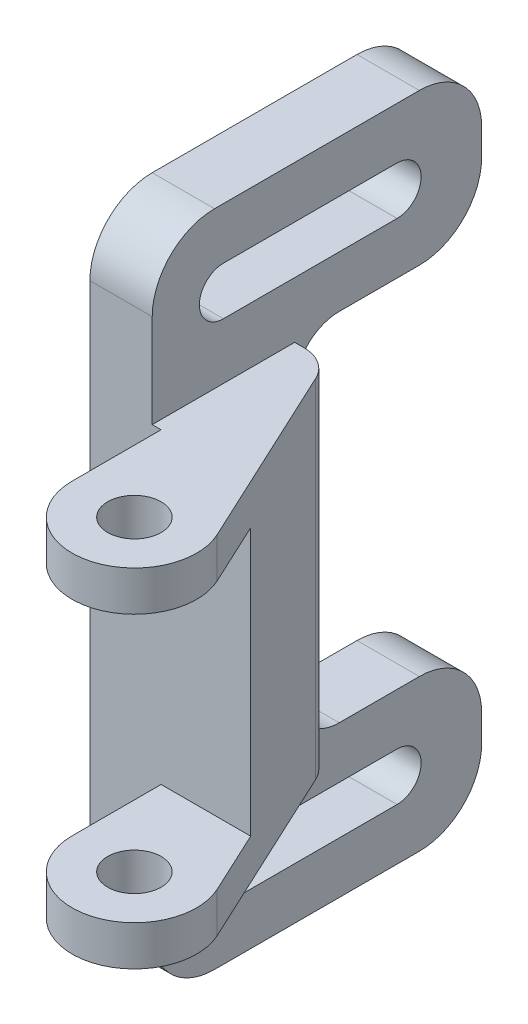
ISO-10303-21;
HEADER;
FILE_DESCRIPTION(('STEP AP214'),'2;1');
FILE_NAME('part.step','',(''),(''),'','','');
FILE_SCHEMA(('AUTOMOTIVE_DESIGN { 1 0 10303 214 1 1 1 1 }'));
ENDSEC;
DATA;
#1=APPLICATION_CONTEXT('core data for automotive mechanical design processes');
#2=APPLICATION_PROTOCOL_DEFINITION('international standard','automotive_design',2000,#1);
#3=PRODUCT_CONTEXT('',#1,'mechanical');
#4=PRODUCT('Part','Part','',(#3));
#5=PRODUCT_RELATED_PRODUCT_CATEGORY('part','',(#4));
#6=PRODUCT_DEFINITION_FORMATION('','',#4);
#7=PRODUCT_DEFINITION_CONTEXT('part definition',#1,'design');
#8=PRODUCT_DEFINITION('design','',#6,#7);
#9=PRODUCT_DEFINITION_SHAPE('','',#8);
#10=(LENGTH_UNIT() NAMED_UNIT(*) SI_UNIT(.MILLI.,.METRE.));
#11=(NAMED_UNIT(*) PLANE_ANGLE_UNIT() SI_UNIT($,.RADIAN.));
#12=(NAMED_UNIT(*) SI_UNIT($,.STERADIAN.) SOLID_ANGLE_UNIT());
#13=UNCERTAINTY_MEASURE_WITH_UNIT(LENGTH_MEASURE(1.E-05),#10,'distance_accuracy_value','');
#14=(GEOMETRIC_REPRESENTATION_CONTEXT(3) GLOBAL_UNCERTAINTY_ASSIGNED_CONTEXT((#13)) GLOBAL_UNIT_ASSIGNED_CONTEXT((#10,
#11,#12)) REPRESENTATION_CONTEXT('',''));
#15=CARTESIAN_POINT('',(0.,0.,0.));
#16=DIRECTION('',(0.,0.,1.));
#17=DIRECTION('',(1.,0.,0.));
#18=AXIS2_PLACEMENT_3D('',#15,#16,#17);
#19=CARTESIAN_POINT('',(15.,-19.5,0.));
#20=DIRECTION('',(0.,-1.,0.));
#21=DIRECTION('',(0.,0.,-1.));
#22=AXIS2_PLACEMENT_3D('',#19,#20,#21);
#23=CYLINDRICAL_SURFACE('',#22,3.);
#24=CARTESIAN_POINT('',(15.,-19.5,0.));
#25=DIRECTION('',(0.,-1.,0.));
#26=DIRECTION('',(0.,0.,-1.));
#27=AXIS2_PLACEMENT_3D('',#24,#25,#26);
#28=CIRCLE('',#27,3.);
#29=CARTESIAN_POINT('',(15.,-19.5,-3.));
#30=VERTEX_POINT('',#29);
#31=EDGE_CURVE('E474',#30,#30,#28,.F.);
#32=ORIENTED_EDGE('',*,*,#31,.F.);
#33=EDGE_LOOP('',(#32));
#34=FACE_BOUND('',#33,.T.);
#35=CARTESIAN_POINT('',(15.,-15.,0.));
#36=DIRECTION('',(0.,-1.,0.));
#37=DIRECTION('',(0.,0.,-1.));
#38=AXIS2_PLACEMENT_3D('',#35,#36,#37);
#39=CIRCLE('',#38,3.);
#40=CARTESIAN_POINT('',(15.,-15.,-3.));
#41=VERTEX_POINT('',#40);
#42=EDGE_CURVE('E305',#41,#41,#39,.F.);
#43=ORIENTED_EDGE('',*,*,#42,.T.);
#44=EDGE_LOOP('',(#43));
#45=FACE_BOUND('',#44,.T.);
#46=ADVANCED_FACE('F16',(#34,#45),#23,.F.);
#47=CARTESIAN_POINT('',(15.,-19.5,0.));
#48=DIRECTION('',(0.,-1.,0.));
#49=DIRECTION('',(0.,0.,-1.));
#50=AXIS2_PLACEMENT_3D('',#47,#48,#49);
#51=CYLINDRICAL_SURFACE('',#50,7.);
#52=CARTESIAN_POINT('',(15.,-19.5,0.));
#53=DIRECTION('',(0.,-1.,0.));
#54=DIRECTION('',(0.,0.,-1.));
#55=AXIS2_PLACEMENT_3D('',#52,#53,#54);
#56=CIRCLE('',#55,7.);
#57=CARTESIAN_POINT('',(21.3441545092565,-19.5,-2.9583278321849));
#58=VERTEX_POINT('',#57);
#59=CARTESIAN_POINT('',(8.,-19.5,0.));
#60=VERTEX_POINT('',#59);
#61=EDGE_CURVE('E479',#58,#60,#56,.T.);
#62=ORIENTED_EDGE('',*,*,#61,.F.);
#63=DIRECTION('',(0.,1.,0.));
#64=VECTOR('',#63,1.);
#65=CARTESIAN_POINT('',(21.3441545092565,-19.5,-2.95832783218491));
#66=LINE('',#65,#64);
#67=CARTESIAN_POINT('',(21.3441545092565,-15.,-2.9583278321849));
#68=VERTEX_POINT('',#67);
#69=EDGE_CURVE('E298',#68,#58,#66,.F.);
#70=ORIENTED_EDGE('',*,*,#69,.F.);
#71=CARTESIAN_POINT('',(15.,-15.,0.));
#72=DIRECTION('',(0.,-1.,0.));
#73=DIRECTION('',(0.,0.,-1.));
#74=AXIS2_PLACEMENT_3D('',#71,#72,#73);
#75=CIRCLE('',#74,7.);
#76=CARTESIAN_POINT('',(8.,-15.,0.));
#77=VERTEX_POINT('',#76);
#78=EDGE_CURVE('E317',#68,#77,#75,.T.);
#79=ORIENTED_EDGE('',*,*,#78,.T.);
#80=DIRECTION('',(0.,1.,0.));
#81=VECTOR('',#80,1.);
#82=CARTESIAN_POINT('',(8.,-19.5,0.));
#83=LINE('',#82,#81);
#84=EDGE_CURVE('E314',#60,#77,#83,.T.);
#85=ORIENTED_EDGE('',*,*,#84,.F.);
#86=EDGE_LOOP('',(#62,#70,#79,#85));
#87=FACE_BOUND('',#86,.T.);
#88=ADVANCED_FACE('F939',(#87),#51,.T.);
#89=CARTESIAN_POINT('',(15.,-19.5,0.));
#90=DIRECTION('',(0.,-1.,0.));
#91=DIRECTION('',(0.,0.,-1.));
#92=AXIS2_PLACEMENT_3D('',#89,#90,#91);
#93=CYLINDRICAL_SURFACE('',#92,7.);
#94=CARTESIAN_POINT('',(15.,15.,0.));
#95=DIRECTION('',(0.,-1.,0.));
#96=DIRECTION('',(0.,0.,-1.));
#97=AXIS2_PLACEMENT_3D('',#94,#95,#96);
#98=CIRCLE('',#97,7.);
#99=CARTESIAN_POINT('',(21.3441545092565,15.,-2.95832783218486));
#100=VERTEX_POINT('',#99);
#101=CARTESIAN_POINT('',(8.,15.,0.));
#102=VERTEX_POINT('',#101);
#103=EDGE_CURVE('E282',#100,#102,#98,.T.);
#104=ORIENTED_EDGE('',*,*,#103,.F.);
#105=DIRECTION('',(0.,1.,0.));
#106=VECTOR('',#105,1.);
#107=CARTESIAN_POINT('',(21.3441545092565,-19.5,-2.95832783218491));
#108=LINE('',#107,#106);
#109=CARTESIAN_POINT('',(21.3441545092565,19.5,-2.9583278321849));
#110=VERTEX_POINT('',#109);
#111=EDGE_CURVE('E273',#110,#100,#108,.F.);
#112=ORIENTED_EDGE('',*,*,#111,.F.);
#113=CARTESIAN_POINT('',(15.,19.5,0.));
#114=DIRECTION('',(0.,-1.,0.));
#115=DIRECTION('',(0.,0.,-1.));
#116=AXIS2_PLACEMENT_3D('',#113,#114,#115);
#117=CIRCLE('',#116,7.);
#118=CARTESIAN_POINT('',(8.,19.5,0.));
#119=VERTEX_POINT('',#118);
#120=EDGE_CURVE('E19',#110,#119,#117,.T.);
#121=ORIENTED_EDGE('',*,*,#120,.T.);
#122=DIRECTION('',(0.,1.,0.));
#123=VECTOR('',#122,1.);
#124=CARTESIAN_POINT('',(8.,-19.5,0.));
#125=LINE('',#124,#123);
#126=EDGE_CURVE('E332',#102,#119,#125,.T.);
#127=ORIENTED_EDGE('',*,*,#126,.F.);
#128=EDGE_LOOP('',(#104,#112,#121,#127));
#129=FACE_BOUND('',#128,.T.);
#130=ADVANCED_FACE('F281',(#129),#93,.T.);
#131=CARTESIAN_POINT('',(15.,-19.5,0.));
#132=DIRECTION('',(0.,-1.,0.));
#133=DIRECTION('',(0.,0.,-1.));
#134=AXIS2_PLACEMENT_3D('',#131,#132,#133);
#135=CYLINDRICAL_SURFACE('',#134,3.);
#136=CARTESIAN_POINT('',(15.,15.,0.));
#137=DIRECTION('',(0.,-1.,0.));
#138=DIRECTION('',(0.,0.,-1.));
#139=AXIS2_PLACEMENT_3D('',#136,#137,#138);
#140=CIRCLE('',#139,3.);
#141=CARTESIAN_POINT('',(15.,15.,-3.));
#142=VERTEX_POINT('',#141);
#143=EDGE_CURVE('E461',#142,#142,#140,.F.);
#144=ORIENTED_EDGE('',*,*,#143,.F.);
#145=EDGE_LOOP('',(#144));
#146=FACE_BOUND('',#145,.T.);
#147=CARTESIAN_POINT('',(15.,19.5,0.));
#148=DIRECTION('',(0.,-1.,0.));
#149=DIRECTION('',(0.,0.,-1.));
#150=AXIS2_PLACEMENT_3D('',#147,#148,#149);
#151=CIRCLE('',#150,3.);
#152=CARTESIAN_POINT('',(15.,19.5,-3.));
#153=VERTEX_POINT('',#152);
#154=EDGE_CURVE('E482',#153,#153,#151,.F.);
#155=ORIENTED_EDGE('',*,*,#154,.T.);
#156=EDGE_LOOP('',(#155));
#157=FACE_BOUND('',#156,.T.);
#158=ADVANCED_FACE('F933',(#146,#157),#135,.F.);
#159=CARTESIAN_POINT('',(0.,19.5,-18.));
#160=DIRECTION('',(0.,-1.,0.));
#161=DIRECTION('',(0.,0.,-1.));
#162=AXIS2_PLACEMENT_3D('',#159,#160,#161);
#163=PLANE('',#162);
#164=ORIENTED_EDGE('',*,*,#154,.F.);
#165=EDGE_LOOP('',(#164));
#166=FACE_BOUND('',#165,.T.);
#167=DIRECTION('',(0.,0.,-1.));
#168=VECTOR('',#167,1.);
#169=CARTESIAN_POINT('',(7.,19.5,-18.));
#170=LINE('',#169,#168);
#171=CARTESIAN_POINT('',(7.,19.5,-10.));
#172=VERTEX_POINT('',#171);
#173=CARTESIAN_POINT('',(7.,19.5,-26.));
#174=VERTEX_POINT('',#173);
#175=EDGE_CURVE('E457',#172,#174,#170,.T.);
#176=ORIENTED_EDGE('',*,*,#175,.F.);
#177=DIRECTION('',(1.,0.,0.));
#178=VECTOR('',#177,1.);
#179=CARTESIAN_POINT('',(0.,19.5,-10.));
#180=LINE('',#179,#178);
#181=CARTESIAN_POINT('',(8.,19.5,-10.));
#182=VERTEX_POINT('',#181);
#183=EDGE_CURVE('E269',#182,#172,#180,.F.);
#184=ORIENTED_EDGE('',*,*,#183,.F.);
#185=DIRECTION('',(0.,0.,1.));
#186=VECTOR('',#185,1.);
#187=CARTESIAN_POINT('',(8.,19.5,0.));
#188=LINE('',#187,#186);
#189=EDGE_CURVE('E264',#119,#182,#188,.F.);
#190=ORIENTED_EDGE('',*,*,#189,.F.);
#191=ORIENTED_EDGE('',*,*,#120,.F.);
#192=DIRECTION('',(-0.422618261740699,0.,-0.90630778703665));
#193=VECTOR('',#192,1.);
#194=CARTESIAN_POINT('',(11.6765964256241,19.5,-23.6904730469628));
#195=LINE('',#194,#193);
#196=CARTESIAN_POINT('',(11.6765964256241,19.5,-23.6904730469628));
#197=VERTEX_POINT('',#196);
#198=EDGE_CURVE('E260',#197,#110,#195,.F.);
#199=ORIENTED_EDGE('',*,*,#198,.F.);
#200=CARTESIAN_POINT('',(8.05136527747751,19.5,-22.));
#201=DIRECTION('',(0.,-1.,0.));
#202=DIRECTION('',(0.,0.,-1.));
#203=AXIS2_PLACEMENT_3D('',#200,#201,#202);
#204=CIRCLE('',#203,4.);
#205=CARTESIAN_POINT('',(8.0513652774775,19.5,-26.));
#206=VERTEX_POINT('',#205);
#207=EDGE_CURVE('E458',#206,#197,#204,.T.);
#208=ORIENTED_EDGE('',*,*,#207,.F.);
#209=DIRECTION('',(1.,0.,0.));
#210=VECTOR('',#209,1.);
#211=CARTESIAN_POINT('',(0.,19.5,-26.));
#212=LINE('',#211,#210);
#213=EDGE_CURVE('E485',#174,#206,#212,.T.);
#214=ORIENTED_EDGE('',*,*,#213,.F.);
#215=EDGE_LOOP('',(#176,#184,#190,#191,#199,#208,#214));
#216=FACE_BOUND('',#215,.T.);
#217=ADVANCED_FACE('F258',(#166,#216),#163,.F.);
#218=CARTESIAN_POINT('',(0.,-19.5,-18.));
#219=DIRECTION('',(0.,-1.,0.));
#220=DIRECTION('',(0.,0.,-1.));
#221=AXIS2_PLACEMENT_3D('',#218,#219,#220);
#222=PLANE('',#221);
#223=ORIENTED_EDGE('',*,*,#31,.T.);
#224=EDGE_LOOP('',(#223));
#225=FACE_BOUND('',#224,.T.);
#226=DIRECTION('',(0.,0.,1.));
#227=VECTOR('',#226,1.);
#228=CARTESIAN_POINT('',(8.,-19.5,0.));
#229=LINE('',#228,#227);
#230=CARTESIAN_POINT('',(8.,-19.5,-10.));
#231=VERTEX_POINT('',#230);
#232=EDGE_CURVE('E318',#231,#60,#229,.T.);
#233=ORIENTED_EDGE('',*,*,#232,.F.);
#234=DIRECTION('',(1.,0.,0.));
#235=VECTOR('',#234,1.);
#236=CARTESIAN_POINT('',(0.,-19.5,-10.));
#237=LINE('',#236,#235);
#238=CARTESIAN_POINT('',(7.,-19.5,-10.));
#239=VERTEX_POINT('',#238);
#240=EDGE_CURVE('E478',#231,#239,#237,.F.);
#241=ORIENTED_EDGE('',*,*,#240,.T.);
#242=DIRECTION('',(0.,0.,-1.));
#243=VECTOR('',#242,1.);
#244=CARTESIAN_POINT('',(7.,-19.5,-18.));
#245=LINE('',#244,#243);
#246=CARTESIAN_POINT('',(7.,-19.5,-26.));
#247=VERTEX_POINT('',#246);
#248=EDGE_CURVE('E558',#247,#239,#245,.F.);
#249=ORIENTED_EDGE('',*,*,#248,.F.);
#250=DIRECTION('',(1.,0.,0.));
#251=VECTOR('',#250,1.);
#252=CARTESIAN_POINT('',(0.,-19.5,-26.));
#253=LINE('',#252,#251);
#254=CARTESIAN_POINT('',(8.0513652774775,-19.5,-26.));
#255=VERTEX_POINT('',#254);
#256=EDGE_CURVE('E481',#247,#255,#253,.T.);
#257=ORIENTED_EDGE('',*,*,#256,.T.);
#258=CARTESIAN_POINT('',(8.05136527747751,-19.5,-22.));
#259=DIRECTION('',(0.,-1.,0.));
#260=DIRECTION('',(0.,0.,-1.));
#261=AXIS2_PLACEMENT_3D('',#258,#259,#260);
#262=CIRCLE('',#261,4.);
#263=CARTESIAN_POINT('',(11.6765964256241,-19.5,-23.6904730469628));
#264=VERTEX_POINT('',#263);
#265=EDGE_CURVE('E453',#264,#255,#262,.F.);
#266=ORIENTED_EDGE('',*,*,#265,.F.);
#267=DIRECTION('',(-0.422618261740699,0.,-0.90630778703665));
#268=VECTOR('',#267,1.);
#269=CARTESIAN_POINT('',(11.6765964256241,-19.5,-23.6904730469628));
#270=LINE('',#269,#268);
#271=EDGE_CURVE('E278',#58,#264,#270,.T.);
#272=ORIENTED_EDGE('',*,*,#271,.F.);
#273=ORIENTED_EDGE('',*,*,#61,.T.);
#274=EDGE_LOOP('',(#233,#241,#249,#257,#266,#272,#273));
#275=FACE_BOUND('',#274,.T.);
#276=ADVANCED_FACE('F619',(#225,#275),#222,.T.);
#277=CARTESIAN_POINT('',(8.,-19.5,0.));
#278=DIRECTION('',(-1.,0.,0.));
#279=DIRECTION('',(0.,0.,1.));
#280=AXIS2_PLACEMENT_3D('',#277,#278,#279);
#281=PLANE('',#280);
#282=ORIENTED_EDGE('',*,*,#189,.T.);
#283=DIRECTION('',(0.,1.,0.));
#284=VECTOR('',#283,1.);
#285=CARTESIAN_POINT('',(8.,-30.,-10.));
#286=LINE('',#285,#284);
#287=CARTESIAN_POINT('',(8.,15.,-10.));
#288=VERTEX_POINT('',#287);
#289=EDGE_CURVE('E525',#288,#182,#286,.T.);
#290=ORIENTED_EDGE('',*,*,#289,.F.);
#291=DIRECTION('',(0.,0.,-1.));
#292=VECTOR('',#291,1.);
#293=CARTESIAN_POINT('',(8.,15.,-18.));
#294=LINE('',#293,#292);
#295=EDGE_CURVE('E464',#102,#288,#294,.T.);
#296=ORIENTED_EDGE('',*,*,#295,.F.);
#297=ORIENTED_EDGE('',*,*,#126,.T.);
#298=EDGE_LOOP('',(#282,#290,#296,#297));
#299=FACE_BOUND('',#298,.T.);
#300=ADVANCED_FACE('F881',(#299),#281,.T.);
#301=CARTESIAN_POINT('',(8.,-19.5,0.));
#302=DIRECTION('',(-1.,0.,0.));
#303=DIRECTION('',(0.,0.,1.));
#304=AXIS2_PLACEMENT_3D('',#301,#302,#303);
#305=PLANE('',#304);
#306=ORIENTED_EDGE('',*,*,#232,.T.);
#307=ORIENTED_EDGE('',*,*,#84,.T.);
#308=DIRECTION('',(0.,0.,-1.));
#309=VECTOR('',#308,1.);
#310=CARTESIAN_POINT('',(8.,-15.,-18.));
#311=LINE('',#310,#309);
#312=CARTESIAN_POINT('',(8.,-15.,-10.));
#313=VERTEX_POINT('',#312);
#314=EDGE_CURVE('E470',#77,#313,#311,.T.);
#315=ORIENTED_EDGE('',*,*,#314,.T.);
#316=DIRECTION('',(0.,1.,0.));
#317=VECTOR('',#316,1.);
#318=CARTESIAN_POINT('',(8.,-30.,-10.));
#319=LINE('',#318,#317);
#320=EDGE_CURVE('E311',#231,#313,#319,.T.);
#321=ORIENTED_EDGE('',*,*,#320,.F.);
#322=EDGE_LOOP('',(#306,#307,#315,#321));
#323=FACE_BOUND('',#322,.T.);
#324=ADVANCED_FACE('F903',(#323),#305,.T.);
#325=CARTESIAN_POINT('',(0.,-15.,-18.));
#326=DIRECTION('',(0.,-1.,0.));
#327=DIRECTION('',(0.,0.,-1.));
#328=AXIS2_PLACEMENT_3D('',#325,#326,#327);
#329=PLANE('',#328);
#330=ORIENTED_EDGE('',*,*,#42,.F.);
#331=EDGE_LOOP('',(#330));
#332=FACE_BOUND('',#331,.T.);
#333=DIRECTION('',(1.,0.,0.));
#334=VECTOR('',#333,1.);
#335=CARTESIAN_POINT('',(0.,-15.,-10.));
#336=LINE('',#335,#334);
#337=CARTESIAN_POINT('',(18.0605688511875,-15.,-9.99999999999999));
#338=VERTEX_POINT('',#337);
#339=EDGE_CURVE('E295',#313,#338,#336,.T.);
#340=ORIENTED_EDGE('',*,*,#339,.F.);
#341=ORIENTED_EDGE('',*,*,#314,.F.);
#342=ORIENTED_EDGE('',*,*,#78,.F.);
#343=DIRECTION('',(-0.422618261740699,0.,-0.90630778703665));
#344=VECTOR('',#343,1.);
#345=CARTESIAN_POINT('',(11.6765964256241,-15.,-23.6904730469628));
#346=LINE('',#345,#344);
#347=EDGE_CURVE('E301',#338,#68,#346,.F.);
#348=ORIENTED_EDGE('',*,*,#347,.F.);
#349=EDGE_LOOP('',(#340,#341,#342,#348));
#350=FACE_BOUND('',#349,.T.);
#351=ADVANCED_FACE('F906',(#332,#350),#329,.F.);
#352=CARTESIAN_POINT('',(11.6765964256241,-19.5,-23.6904730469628));
#353=DIRECTION('',(0.90630778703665,0.,-0.422618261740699));
#354=DIRECTION('',(-0.422618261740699,0.,-0.90630778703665));
#355=AXIS2_PLACEMENT_3D('',#352,#353,#354);
#356=PLANE('',#355);
#357=ORIENTED_EDGE('',*,*,#198,.T.);
#358=ORIENTED_EDGE('',*,*,#111,.T.);
#359=DIRECTION('',(0.42261826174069,0.,0.906307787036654));
#360=VECTOR('',#359,1.);
#361=CARTESIAN_POINT('',(18.0605688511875,15.,-10.));
#362=LINE('',#361,#360);
#363=CARTESIAN_POINT('',(18.0605688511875,15.,-10.));
#364=VERTEX_POINT('',#363);
#365=EDGE_CURVE('E283',#364,#100,#362,.T.);
#366=ORIENTED_EDGE('',*,*,#365,.F.);
#367=DIRECTION('',(0.,1.,0.));
#368=VECTOR('',#367,1.);
#369=CARTESIAN_POINT('',(18.0605688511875,-30.,-10.));
#370=LINE('',#369,#368);
#371=EDGE_CURVE('E290',#338,#364,#370,.T.);
#372=ORIENTED_EDGE('',*,*,#371,.F.);
#373=ORIENTED_EDGE('',*,*,#347,.T.);
#374=ORIENTED_EDGE('',*,*,#69,.T.);
#375=ORIENTED_EDGE('',*,*,#271,.T.);
#376=DIRECTION('',(0.,-1.,0.));
#377=VECTOR('',#376,1.);
#378=CARTESIAN_POINT('',(11.6765964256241,-19.5,-23.6904730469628));
#379=LINE('',#378,#377);
#380=EDGE_CURVE('E276',#197,#264,#379,.T.);
#381=ORIENTED_EDGE('',*,*,#380,.F.);
#382=EDGE_LOOP('',(#357,#358,#366,#372,#373,#374,#375,#381));
#383=FACE_BOUND('',#382,.T.);
#384=ADVANCED_FACE('F271',(#383),#356,.T.);
#385=CARTESIAN_POINT('',(0.,15.,-18.));
#386=DIRECTION('',(0.,-1.,0.));
#387=DIRECTION('',(0.,0.,-1.));
#388=AXIS2_PLACEMENT_3D('',#385,#386,#387);
#389=PLANE('',#388);
#390=ORIENTED_EDGE('',*,*,#143,.T.);
#391=EDGE_LOOP('',(#390));
#392=FACE_BOUND('',#391,.T.);
#393=ORIENTED_EDGE('',*,*,#295,.T.);
#394=DIRECTION('',(1.,0.,0.));
#395=VECTOR('',#394,1.);
#396=CARTESIAN_POINT('',(0.,15.,-10.));
#397=LINE('',#396,#395);
#398=EDGE_CURVE('E294',#364,#288,#397,.F.);
#399=ORIENTED_EDGE('',*,*,#398,.F.);
#400=ORIENTED_EDGE('',*,*,#365,.T.);
#401=ORIENTED_EDGE('',*,*,#103,.T.);
#402=EDGE_LOOP('',(#393,#399,#400,#401));
#403=FACE_BOUND('',#402,.T.);
#404=ADVANCED_FACE('F909',(#392,#403),#389,.T.);
#405=CARTESIAN_POINT('',(8.05136527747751,-19.5,-22.));
#406=DIRECTION('',(0.,-1.,0.));
#407=DIRECTION('',(0.,0.,-1.));
#408=AXIS2_PLACEMENT_3D('',#405,#406,#407);
#409=CYLINDRICAL_SURFACE('',#408,4.);
#410=ORIENTED_EDGE('',*,*,#265,.T.);
#411=DIRECTION('',(0.,1.,0.));
#412=VECTOR('',#411,1.);
#413=CARTESIAN_POINT('',(8.0513652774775,15.,-26.));
#414=LINE('',#413,#412);
#415=EDGE_CURVE('E512',#206,#255,#414,.F.);
#416=ORIENTED_EDGE('',*,*,#415,.F.);
#417=ORIENTED_EDGE('',*,*,#207,.T.);
#418=ORIENTED_EDGE('',*,*,#380,.T.);
#419=EDGE_LOOP('',(#410,#416,#417,#418));
#420=FACE_BOUND('',#419,.T.);
#421=ADVANCED_FACE('F741',(#420),#409,.T.);
#422=CARTESIAN_POINT('',(7.,0.,-18.));
#423=DIRECTION('',(1.,0.,0.));
#424=DIRECTION('',(0.,0.,-1.));
#425=AXIS2_PLACEMENT_3D('',#422,#423,#424);
#426=PLANE('',#425);
#427=CARTESIAN_POINT('',(7.,28.5,-18.));
#428=DIRECTION('',(-1.,0.,0.));
#429=DIRECTION('',(0.,0.,1.));
#430=AXIS2_PLACEMENT_3D('',#427,#428,#429);
#431=CIRCLE('',#430,2.7);
#432=CARTESIAN_POINT('',(7.,25.8,-18.));
#433=VERTEX_POINT('',#432);
#434=CARTESIAN_POINT('',(7.,31.2,-18.));
#435=VERTEX_POINT('',#434);
#436=EDGE_CURVE('E407',#433,#435,#431,.T.);
#437=ORIENTED_EDGE('',*,*,#436,.T.);
#438=DIRECTION('',(0.,0.,-1.));
#439=VECTOR('',#438,1.);
#440=CARTESIAN_POINT('',(7.,31.2,-37.5));
#441=LINE('',#440,#439);
#442=CARTESIAN_POINT('',(7.,31.2,-37.5));
#443=VERTEX_POINT('',#442);
#444=EDGE_CURVE('E411',#443,#435,#441,.F.);
#445=ORIENTED_EDGE('',*,*,#444,.F.);
#446=CARTESIAN_POINT('',(7.,28.5,-37.5));
#447=DIRECTION('',(-1.,0.,0.));
#448=DIRECTION('',(0.,0.,1.));
#449=AXIS2_PLACEMENT_3D('',#446,#447,#448);
#450=CIRCLE('',#449,2.7);
#451=CARTESIAN_POINT('',(7.,25.8,-37.5));
#452=VERTEX_POINT('',#451);
#453=EDGE_CURVE('E401',#443,#452,#450,.T.);
#454=ORIENTED_EDGE('',*,*,#453,.T.);
#455=DIRECTION('',(0.,0.,1.));
#456=VECTOR('',#455,1.);
#457=CARTESIAN_POINT('',(7.,25.8,-18.));
#458=LINE('',#457,#456);
#459=EDGE_CURVE('E405',#433,#452,#458,.F.);
#460=ORIENTED_EDGE('',*,*,#459,.F.);
#461=EDGE_LOOP('',(#437,#445,#454,#460));
#462=FACE_BOUND('',#461,.T.);
#463=DIRECTION('',(0.,1.,0.));
#464=VECTOR('',#463,1.);
#465=CARTESIAN_POINT('',(6.99999999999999,-30.,-10.));
#466=LINE('',#465,#464);
#467=CARTESIAN_POINT('',(7.,30.,-10.));
#468=VERTEX_POINT('',#467);
#469=EDGE_CURVE('E528',#172,#468,#466,.T.);
#470=ORIENTED_EDGE('',*,*,#469,.F.);
#471=ORIENTED_EDGE('',*,*,#175,.T.);
#472=DIRECTION('',(0.,1.,0.));
#473=VECTOR('',#472,1.);
#474=CARTESIAN_POINT('',(7.,15.,-26.));
#475=LINE('',#474,#473);
#476=CARTESIAN_POINT('',(7.,15.,-26.));
#477=VERTEX_POINT('',#476);
#478=EDGE_CURVE('E516',#477,#174,#475,.T.);
#479=ORIENTED_EDGE('',*,*,#478,.F.);
#480=CARTESIAN_POINT('',(7.,15.,-31.));
#481=DIRECTION('',(-1.,0.,0.));
#482=DIRECTION('',(0.,0.,1.));
#483=AXIS2_PLACEMENT_3D('',#480,#481,#482);
#484=CIRCLE('',#483,5.);
#485=CARTESIAN_POINT('',(7.,20.,-31.));
#486=VERTEX_POINT('',#485);
#487=EDGE_CURVE('E423',#477,#486,#484,.T.);
#488=ORIENTED_EDGE('',*,*,#487,.T.);
#489=DIRECTION('',(0.,0.,-1.));
#490=VECTOR('',#489,1.);
#491=CARTESIAN_POINT('',(7.,20.,-40.));
#492=LINE('',#491,#490);
#493=CARTESIAN_POINT('',(7.,20.,-40.));
#494=VERTEX_POINT('',#493);
#495=EDGE_CURVE('E427',#494,#486,#492,.F.);
#496=ORIENTED_EDGE('',*,*,#495,.F.);
#497=CARTESIAN_POINT('',(7.,27.,-40.));
#498=DIRECTION('',(-1.,0.,0.));
#499=DIRECTION('',(0.,0.,1.));
#500=AXIS2_PLACEMENT_3D('',#497,#498,#499);
#501=CIRCLE('',#500,7.00000000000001);
#502=CARTESIAN_POINT('',(7.,27.,-47.));
#503=VERTEX_POINT('',#502);
#504=EDGE_CURVE('E418',#503,#494,#501,.T.);
#505=ORIENTED_EDGE('',*,*,#504,.F.);
#506=DIRECTION('',(0.,1.,0.));
#507=VECTOR('',#506,1.);
#508=CARTESIAN_POINT('',(7.,30.,-47.));
#509=LINE('',#508,#507);
#510=CARTESIAN_POINT('',(7.,30.,-47.));
#511=VERTEX_POINT('',#510);
#512=EDGE_CURVE('E559',#511,#503,#509,.F.);
#513=ORIENTED_EDGE('',*,*,#512,.F.);
#514=CARTESIAN_POINT('',(7.,30.,-40.));
#515=DIRECTION('',(-1.,0.,0.));
#516=DIRECTION('',(0.,0.,1.));
#517=AXIS2_PLACEMENT_3D('',#514,#515,#516);
#518=CIRCLE('',#517,7.00000000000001);
#519=CARTESIAN_POINT('',(7.,37.,-40.));
#520=VERTEX_POINT('',#519);
#521=EDGE_CURVE('E413',#520,#511,#518,.T.);
#522=ORIENTED_EDGE('',*,*,#521,.F.);
#523=DIRECTION('',(0.,0.,1.));
#524=VECTOR('',#523,1.);
#525=CARTESIAN_POINT('',(7.,37.,-17.));
#526=LINE('',#525,#524);
#527=CARTESIAN_POINT('',(7.,37.,-17.));
#528=VERTEX_POINT('',#527);
#529=EDGE_CURVE('E452',#528,#520,#526,.F.);
#530=ORIENTED_EDGE('',*,*,#529,.F.);
#531=CARTESIAN_POINT('',(7.,30.,-17.));
#532=DIRECTION('',(-1.,0.,0.));
#533=DIRECTION('',(0.,0.,1.));
#534=AXIS2_PLACEMENT_3D('',#531,#532,#533);
#535=CIRCLE('',#534,7.);
#536=EDGE_CURVE('E448',#468,#528,#535,.T.);
#537=ORIENTED_EDGE('',*,*,#536,.F.);
#538=EDGE_LOOP('',(#470,#471,#479,#488,#496,#505,#513,#522,#530,#537));
#539=FACE_BOUND('',#538,.T.);
#540=ADVANCED_FACE('F730',(#462,#539),#426,.T.);
#541=CARTESIAN_POINT('',(7.,0.,-18.));
#542=DIRECTION('',(1.,0.,0.));
#543=DIRECTION('',(0.,0.,-1.));
#544=AXIS2_PLACEMENT_3D('',#541,#542,#543);
#545=PLANE('',#544);
#546=CARTESIAN_POINT('',(7.,-28.5,-18.));
#547=DIRECTION('',(-1.,0.,0.));
#548=DIRECTION('',(0.,0.,1.));
#549=AXIS2_PLACEMENT_3D('',#546,#547,#548);
#550=CIRCLE('',#549,2.7);
#551=CARTESIAN_POINT('',(7.,-31.2,-18.));
#552=VERTEX_POINT('',#551);
#553=CARTESIAN_POINT('',(7.,-25.8,-18.));
#554=VERTEX_POINT('',#553);
#555=EDGE_CURVE('E396',#552,#554,#550,.T.);
#556=ORIENTED_EDGE('',*,*,#555,.T.);
#557=DIRECTION('',(0.,0.,-1.));
#558=VECTOR('',#557,1.);
#559=CARTESIAN_POINT('',(7.,-25.8,-37.5));
#560=LINE('',#559,#558);
#561=CARTESIAN_POINT('',(7.,-25.8,-37.5));
#562=VERTEX_POINT('',#561);
#563=EDGE_CURVE('E399',#562,#554,#560,.F.);
#564=ORIENTED_EDGE('',*,*,#563,.F.);
#565=CARTESIAN_POINT('',(7.,-28.5,-37.5));
#566=DIRECTION('',(-1.,0.,0.));
#567=DIRECTION('',(0.,0.,1.));
#568=AXIS2_PLACEMENT_3D('',#565,#566,#567);
#569=CIRCLE('',#568,2.7);
#570=CARTESIAN_POINT('',(7.,-31.2,-37.5));
#571=VERTEX_POINT('',#570);
#572=EDGE_CURVE('E390',#562,#571,#569,.T.);
#573=ORIENTED_EDGE('',*,*,#572,.T.);
#574=DIRECTION('',(0.,0.,1.));
#575=VECTOR('',#574,1.);
#576=CARTESIAN_POINT('',(7.,-31.2,-18.));
#577=LINE('',#576,#575);
#578=EDGE_CURVE('E394',#552,#571,#577,.F.);
#579=ORIENTED_EDGE('',*,*,#578,.F.);
#580=EDGE_LOOP('',(#556,#564,#573,#579));
#581=FACE_BOUND('',#580,.T.);
#582=DIRECTION('',(0.,0.,1.));
#583=VECTOR('',#582,1.);
#584=CARTESIAN_POINT('',(7.,-20.,-31.));
#585=LINE('',#584,#583);
#586=CARTESIAN_POINT('',(7.,-20.,-31.));
#587=VERTEX_POINT('',#586);
#588=CARTESIAN_POINT('',(7.,-20.,-40.));
#589=VERTEX_POINT('',#588);
#590=EDGE_CURVE('E582',#587,#589,#585,.F.);
#591=ORIENTED_EDGE('',*,*,#590,.F.);
#592=CARTESIAN_POINT('',(7.,-15.,-31.));
#593=DIRECTION('',(-1.,0.,0.));
#594=DIRECTION('',(0.,0.,1.));
#595=AXIS2_PLACEMENT_3D('',#592,#593,#594);
#596=CIRCLE('',#595,5.);
#597=CARTESIAN_POINT('',(7.,-15.,-26.));
#598=VERTEX_POINT('',#597);
#599=EDGE_CURVE('E429',#587,#598,#596,.T.);
#600=ORIENTED_EDGE('',*,*,#599,.T.);
#601=DIRECTION('',(0.,1.,0.));
#602=VECTOR('',#601,1.);
#603=CARTESIAN_POINT('',(7.,15.,-26.));
#604=LINE('',#603,#602);
#605=EDGE_CURVE('E515',#247,#598,#604,.T.);
#606=ORIENTED_EDGE('',*,*,#605,.F.);
#607=ORIENTED_EDGE('',*,*,#248,.T.);
#608=DIRECTION('',(0.,1.,0.));
#609=VECTOR('',#608,1.);
#610=CARTESIAN_POINT('',(7.,-30.,-10.));
#611=LINE('',#610,#609);
#612=CARTESIAN_POINT('',(7.,-30.,-9.99999999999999));
#613=VERTEX_POINT('',#612);
#614=EDGE_CURVE('E322',#613,#239,#611,.T.);
#615=ORIENTED_EDGE('',*,*,#614,.F.);
#616=CARTESIAN_POINT('',(7.,-30.,-17.));
#617=DIRECTION('',(-1.,0.,0.));
#618=DIRECTION('',(0.,0.,1.));
#619=AXIS2_PLACEMENT_3D('',#616,#617,#618);
#620=CIRCLE('',#619,7.00000000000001);
#621=CARTESIAN_POINT('',(7.,-37.,-17.));
#622=VERTEX_POINT('',#621);
#623=EDGE_CURVE('E444',#622,#613,#620,.T.);
#624=ORIENTED_EDGE('',*,*,#623,.F.);
#625=DIRECTION('',(0.,0.,-1.));
#626=VECTOR('',#625,1.);
#627=CARTESIAN_POINT('',(7.,-37.,-40.));
#628=LINE('',#627,#626);
#629=CARTESIAN_POINT('',(7.,-37.,-40.));
#630=VERTEX_POINT('',#629);
#631=EDGE_CURVE('E589',#630,#622,#628,.F.);
#632=ORIENTED_EDGE('',*,*,#631,.F.);
#633=CARTESIAN_POINT('',(7.,-30.,-40.));
#634=DIRECTION('',(-1.,0.,0.));
#635=DIRECTION('',(0.,0.,1.));
#636=AXIS2_PLACEMENT_3D('',#633,#634,#635);
#637=CIRCLE('',#636,7.00000000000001);
#638=CARTESIAN_POINT('',(7.,-30.,-47.));
#639=VERTEX_POINT('',#638);
#640=EDGE_CURVE('E439',#639,#630,#637,.T.);
#641=ORIENTED_EDGE('',*,*,#640,.F.);
#642=DIRECTION('',(0.,1.,0.));
#643=VECTOR('',#642,1.);
#644=CARTESIAN_POINT('',(7.,-27.,-47.));
#645=LINE('',#644,#643);
#646=CARTESIAN_POINT('',(7.,-27.,-47.));
#647=VERTEX_POINT('',#646);
#648=EDGE_CURVE('E586',#647,#639,#645,.F.);
#649=ORIENTED_EDGE('',*,*,#648,.F.);
#650=CARTESIAN_POINT('',(7.,-27.,-40.));
#651=DIRECTION('',(-1.,0.,0.));
#652=DIRECTION('',(0.,0.,1.));
#653=AXIS2_PLACEMENT_3D('',#650,#651,#652);
#654=CIRCLE('',#653,7.00000000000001);
#655=EDGE_CURVE('E434',#589,#647,#654,.T.);
#656=ORIENTED_EDGE('',*,*,#655,.F.);
#657=EDGE_LOOP('',(#591,#600,#606,#607,#615,#624,#632,#641,#649,#656));
#658=FACE_BOUND('',#657,.T.);
#659=ADVANCED_FACE('F627',(#581,#658),#545,.T.);
#660=CARTESIAN_POINT('',(0.,37.,-17.));
#661=DIRECTION('',(0.,1.,0.));
#662=DIRECTION('',(0.,0.,1.));
#663=AXIS2_PLACEMENT_3D('',#660,#661,#662);
#664=PLANE('',#663);
#665=DIRECTION('',(0.,0.,-1.));
#666=VECTOR('',#665,1.);
#667=CARTESIAN_POINT('',(0.,37.,-18.));
#668=LINE('',#667,#666);
#669=CARTESIAN_POINT('',(0.,37.,-40.));
#670=VERTEX_POINT('',#669);
#671=CARTESIAN_POINT('',(0.,37.,-17.));
#672=VERTEX_POINT('',#671);
#673=EDGE_CURVE('E389',#670,#672,#668,.F.);
#674=ORIENTED_EDGE('',*,*,#673,.T.);
#675=DIRECTION('',(-1.,0.,0.));
#676=VECTOR('',#675,1.);
#677=CARTESIAN_POINT('',(0.,37.,-17.));
#678=LINE('',#677,#676);
#679=EDGE_CURVE('E451',#528,#672,#678,.T.);
#680=ORIENTED_EDGE('',*,*,#679,.F.);
#681=ORIENTED_EDGE('',*,*,#529,.T.);
#682=DIRECTION('',(-1.,0.,0.));
#683=VECTOR('',#682,1.);
#684=CARTESIAN_POINT('',(0.,37.,-40.));
#685=LINE('',#684,#683);
#686=EDGE_CURVE('E412',#670,#520,#685,.F.);
#687=ORIENTED_EDGE('',*,*,#686,.F.);
#688=EDGE_LOOP('',(#674,#680,#681,#687));
#689=FACE_BOUND('',#688,.T.);
#690=ADVANCED_FACE('F729',(#689),#664,.T.);
#691=CARTESIAN_POINT('',(0.,30.,-17.));
#692=DIRECTION('',(-1.,0.,0.));
#693=DIRECTION('',(0.,0.,1.));
#694=AXIS2_PLACEMENT_3D('',#691,#692,#693);
#695=CYLINDRICAL_SURFACE('',#694,7.);
#696=CARTESIAN_POINT('',(0.,30.,-17.));
#697=DIRECTION('',(-1.,0.,0.));
#698=DIRECTION('',(0.,0.,1.));
#699=AXIS2_PLACEMENT_3D('',#696,#697,#698);
#700=CIRCLE('',#699,7.);
#701=CARTESIAN_POINT('',(0.,30.,-10.));
#702=VERTEX_POINT('',#701);
#703=EDGE_CURVE('E385',#672,#702,#700,.F.);
#704=ORIENTED_EDGE('',*,*,#703,.T.);
#705=DIRECTION('',(1.,0.,0.));
#706=VECTOR('',#705,1.);
#707=CARTESIAN_POINT('',(0.,30.,-10.));
#708=LINE('',#707,#706);
#709=EDGE_CURVE('E533',#468,#702,#708,.F.);
#710=ORIENTED_EDGE('',*,*,#709,.F.);
#711=ORIENTED_EDGE('',*,*,#536,.T.);
#712=ORIENTED_EDGE('',*,*,#679,.T.);
#713=EDGE_LOOP('',(#704,#710,#711,#712));
#714=FACE_BOUND('',#713,.T.);
#715=ADVANCED_FACE('F737',(#714),#695,.T.);
#716=CARTESIAN_POINT('',(0.,-30.,-10.));
#717=DIRECTION('',(0.,0.,1.));
#718=DIRECTION('',(1.,0.,0.));
#719=AXIS2_PLACEMENT_3D('',#716,#717,#718);
#720=PLANE('',#719);
#721=ORIENTED_EDGE('',*,*,#371,.T.);
#722=ORIENTED_EDGE('',*,*,#398,.T.);
#723=ORIENTED_EDGE('',*,*,#289,.T.);
#724=ORIENTED_EDGE('',*,*,#183,.T.);
#725=ORIENTED_EDGE('',*,*,#469,.T.);
#726=ORIENTED_EDGE('',*,*,#709,.T.);
#727=DIRECTION('',(0.,1.,0.));
#728=VECTOR('',#727,1.);
#729=CARTESIAN_POINT('',(0.,0.,-10.));
#730=LINE('',#729,#728);
#731=CARTESIAN_POINT('',(0.,-30.,-9.99999999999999));
#732=VERTEX_POINT('',#731);
#733=EDGE_CURVE('E384',#702,#732,#730,.F.);
#734=ORIENTED_EDGE('',*,*,#733,.T.);
#735=DIRECTION('',(-1.,0.,0.));
#736=VECTOR('',#735,1.);
#737=CARTESIAN_POINT('',(0.,-30.,-9.99999999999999));
#738=LINE('',#737,#736);
#739=EDGE_CURVE('E447',#613,#732,#738,.T.);
#740=ORIENTED_EDGE('',*,*,#739,.F.);
#741=ORIENTED_EDGE('',*,*,#614,.T.);
#742=ORIENTED_EDGE('',*,*,#240,.F.);
#743=ORIENTED_EDGE('',*,*,#320,.T.);
#744=ORIENTED_EDGE('',*,*,#339,.T.);
#745=EDGE_LOOP('',(#721,#722,#723,#724,#725,#726,#734,#740,#741,#742,#743,#744));
#746=FACE_BOUND('',#745,.T.);
#747=ADVANCED_FACE('F630',(#746),#720,.T.);
#748=CARTESIAN_POINT('',(0.,-30.,-17.));
#749=DIRECTION('',(-1.,0.,0.));
#750=DIRECTION('',(0.,0.,1.));
#751=AXIS2_PLACEMENT_3D('',#748,#749,#750);
#752=CYLINDRICAL_SURFACE('',#751,7.00000000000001);
#753=CARTESIAN_POINT('',(0.,-30.,-17.));
#754=DIRECTION('',(-1.,0.,0.));
#755=DIRECTION('',(0.,0.,1.));
#756=AXIS2_PLACEMENT_3D('',#753,#754,#755);
#757=CIRCLE('',#756,7.00000000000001);
#758=CARTESIAN_POINT('',(0.,-37.,-17.));
#759=VERTEX_POINT('',#758);
#760=EDGE_CURVE('E380',#732,#759,#757,.F.);
#761=ORIENTED_EDGE('',*,*,#760,.T.);
#762=DIRECTION('',(1.,0.,0.));
#763=VECTOR('',#762,1.);
#764=CARTESIAN_POINT('',(0.,-37.,-17.));
#765=LINE('',#764,#763);
#766=EDGE_CURVE('E443',#622,#759,#765,.F.);
#767=ORIENTED_EDGE('',*,*,#766,.F.);
#768=ORIENTED_EDGE('',*,*,#623,.T.);
#769=ORIENTED_EDGE('',*,*,#739,.T.);
#770=EDGE_LOOP('',(#761,#767,#768,#769));
#771=FACE_BOUND('',#770,.T.);
#772=ADVANCED_FACE('F817',(#771),#752,.T.);
#773=CARTESIAN_POINT('',(0.,-37.,-40.));
#774=DIRECTION('',(0.,-1.,0.));
#775=DIRECTION('',(0.,0.,-1.));
#776=AXIS2_PLACEMENT_3D('',#773,#774,#775);
#777=PLANE('',#776);
#778=DIRECTION('',(0.,0.,-1.));
#779=VECTOR('',#778,1.);
#780=CARTESIAN_POINT('',(0.,-37.,-18.));
#781=LINE('',#780,#779);
#782=CARTESIAN_POINT('',(0.,-37.,-40.));
#783=VERTEX_POINT('',#782);
#784=EDGE_CURVE('E379',#759,#783,#781,.T.);
#785=ORIENTED_EDGE('',*,*,#784,.T.);
#786=DIRECTION('',(-1.,0.,0.));
#787=VECTOR('',#786,1.);
#788=CARTESIAN_POINT('',(0.,-37.,-40.));
#789=LINE('',#788,#787);
#790=EDGE_CURVE('E442',#630,#783,#789,.T.);
#791=ORIENTED_EDGE('',*,*,#790,.F.);
#792=ORIENTED_EDGE('',*,*,#631,.T.);
#793=ORIENTED_EDGE('',*,*,#766,.T.);
#794=EDGE_LOOP('',(#785,#791,#792,#793));
#795=FACE_BOUND('',#794,.T.);
#796=ADVANCED_FACE('F813',(#795),#777,.T.);
#797=CARTESIAN_POINT('',(0.,-30.,-40.));
#798=DIRECTION('',(-1.,0.,0.));
#799=DIRECTION('',(0.,0.,1.));
#800=AXIS2_PLACEMENT_3D('',#797,#798,#799);
#801=CYLINDRICAL_SURFACE('',#800,7.00000000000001);
#802=CARTESIAN_POINT('',(0.,-30.,-40.));
#803=DIRECTION('',(-1.,0.,0.));
#804=DIRECTION('',(0.,0.,1.));
#805=AXIS2_PLACEMENT_3D('',#802,#803,#804);
#806=CIRCLE('',#805,7.00000000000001);
#807=CARTESIAN_POINT('',(0.,-30.,-47.));
#808=VERTEX_POINT('',#807);
#809=EDGE_CURVE('E375',#783,#808,#806,.F.);
#810=ORIENTED_EDGE('',*,*,#809,.T.);
#811=DIRECTION('',(-1.,0.,0.));
#812=VECTOR('',#811,1.);
#813=CARTESIAN_POINT('',(0.,-30.,-47.));
#814=LINE('',#813,#812);
#815=EDGE_CURVE('E438',#639,#808,#814,.T.);
#816=ORIENTED_EDGE('',*,*,#815,.F.);
#817=ORIENTED_EDGE('',*,*,#640,.T.);
#818=ORIENTED_EDGE('',*,*,#790,.T.);
#819=EDGE_LOOP('',(#810,#816,#817,#818));
#820=FACE_BOUND('',#819,.T.);
#821=ADVANCED_FACE('F809',(#820),#801,.T.);
#822=CARTESIAN_POINT('',(0.,-27.,-47.));
#823=DIRECTION('',(0.,0.,-1.));
#824=DIRECTION('',(-1.,0.,0.));
#825=AXIS2_PLACEMENT_3D('',#822,#823,#824);
#826=PLANE('',#825);
#827=DIRECTION('',(0.,1.,0.));
#828=VECTOR('',#827,1.);
#829=CARTESIAN_POINT('',(0.,0.,-47.));
#830=LINE('',#829,#828);
#831=CARTESIAN_POINT('',(0.,-27.,-47.));
#832=VERTEX_POINT('',#831);
#833=EDGE_CURVE('E374',#808,#832,#830,.T.);
#834=ORIENTED_EDGE('',*,*,#833,.T.);
#835=DIRECTION('',(-1.,0.,0.));
#836=VECTOR('',#835,1.);
#837=CARTESIAN_POINT('',(0.,-27.,-47.));
#838=LINE('',#837,#836);
#839=EDGE_CURVE('E437',#647,#832,#838,.T.);
#840=ORIENTED_EDGE('',*,*,#839,.F.);
#841=ORIENTED_EDGE('',*,*,#648,.T.);
#842=ORIENTED_EDGE('',*,*,#815,.T.);
#843=EDGE_LOOP('',(#834,#840,#841,#842));
#844=FACE_BOUND('',#843,.T.);
#845=ADVANCED_FACE('F805',(#844),#826,.T.);
#846=CARTESIAN_POINT('',(0.,-27.,-40.));
#847=DIRECTION('',(-1.,0.,0.));
#848=DIRECTION('',(0.,0.,1.));
#849=AXIS2_PLACEMENT_3D('',#846,#847,#848);
#850=CYLINDRICAL_SURFACE('',#849,7.00000000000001);
#851=CARTESIAN_POINT('',(0.,-27.,-40.));
#852=DIRECTION('',(-1.,0.,0.));
#853=DIRECTION('',(0.,0.,1.));
#854=AXIS2_PLACEMENT_3D('',#851,#852,#853);
#855=CIRCLE('',#854,7.00000000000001);
#856=CARTESIAN_POINT('',(0.,-20.,-40.));
#857=VERTEX_POINT('',#856);
#858=EDGE_CURVE('E370',#832,#857,#855,.F.);
#859=ORIENTED_EDGE('',*,*,#858,.T.);
#860=DIRECTION('',(1.,0.,0.));
#861=VECTOR('',#860,1.);
#862=CARTESIAN_POINT('',(0.,-20.,-40.));
#863=LINE('',#862,#861);
#864=EDGE_CURVE('E585',#589,#857,#863,.F.);
#865=ORIENTED_EDGE('',*,*,#864,.F.);
#866=ORIENTED_EDGE('',*,*,#655,.T.);
#867=ORIENTED_EDGE('',*,*,#839,.T.);
#868=EDGE_LOOP('',(#859,#865,#866,#867));
#869=FACE_BOUND('',#868,.T.);
#870=ADVANCED_FACE('F801',(#869),#850,.T.);
#871=CARTESIAN_POINT('',(0.,-20.,-31.));
#872=DIRECTION('',(0.,1.,0.));
#873=DIRECTION('',(0.,0.,1.));
#874=AXIS2_PLACEMENT_3D('',#871,#872,#873);
#875=PLANE('',#874);
#876=DIRECTION('',(0.,0.,-1.));
#877=VECTOR('',#876,1.);
#878=CARTESIAN_POINT('',(0.,-20.,-18.));
#879=LINE('',#878,#877);
#880=CARTESIAN_POINT('',(0.,-20.,-31.));
#881=VERTEX_POINT('',#880);
#882=EDGE_CURVE('E369',#857,#881,#879,.F.);
#883=ORIENTED_EDGE('',*,*,#882,.T.);
#884=DIRECTION('',(-1.,0.,0.));
#885=VECTOR('',#884,1.);
#886=CARTESIAN_POINT('',(0.,-20.,-31.));
#887=LINE('',#886,#885);
#888=EDGE_CURVE('E433',#881,#587,#887,.F.);
#889=ORIENTED_EDGE('',*,*,#888,.T.);
#890=ORIENTED_EDGE('',*,*,#590,.T.);
#891=ORIENTED_EDGE('',*,*,#864,.T.);
#892=EDGE_LOOP('',(#883,#889,#890,#891));
#893=FACE_BOUND('',#892,.T.);
#894=ADVANCED_FACE('F797',(#893),#875,.T.);
#895=CARTESIAN_POINT('',(0.,-15.,-31.));
#896=DIRECTION('',(-1.,0.,0.));
#897=DIRECTION('',(0.,0.,1.));
#898=AXIS2_PLACEMENT_3D('',#895,#896,#897);
#899=CYLINDRICAL_SURFACE('',#898,5.);
#900=ORIENTED_EDGE('',*,*,#888,.F.);
#901=CARTESIAN_POINT('',(0.,-15.,-31.));
#902=DIRECTION('',(-1.,0.,0.));
#903=DIRECTION('',(0.,0.,1.));
#904=AXIS2_PLACEMENT_3D('',#901,#902,#903);
#905=CIRCLE('',#904,5.);
#906=CARTESIAN_POINT('',(0.,-15.,-26.));
#907=VERTEX_POINT('',#906);
#908=EDGE_CURVE('E365',#881,#907,#905,.T.);
#909=ORIENTED_EDGE('',*,*,#908,.T.);
#910=DIRECTION('',(-1.,0.,0.));
#911=VECTOR('',#910,1.);
#912=CARTESIAN_POINT('',(0.,-15.,-26.));
#913=LINE('',#912,#911);
#914=EDGE_CURVE('E432',#598,#907,#913,.T.);
#915=ORIENTED_EDGE('',*,*,#914,.F.);
#916=ORIENTED_EDGE('',*,*,#599,.F.);
#917=EDGE_LOOP('',(#900,#909,#915,#916));
#918=FACE_BOUND('',#917,.T.);
#919=ADVANCED_FACE('F794',(#918),#899,.F.);
#920=CARTESIAN_POINT('',(0.,15.,-26.));
#921=DIRECTION('',(0.,0.,-1.));
#922=DIRECTION('',(-1.,0.,0.));
#923=AXIS2_PLACEMENT_3D('',#920,#921,#922);
#924=PLANE('',#923);
#925=ORIENTED_EDGE('',*,*,#256,.F.);
#926=ORIENTED_EDGE('',*,*,#605,.T.);
#927=ORIENTED_EDGE('',*,*,#914,.T.);
#928=DIRECTION('',(0.,1.,0.));
#929=VECTOR('',#928,1.);
#930=CARTESIAN_POINT('',(0.,0.,-26.));
#931=LINE('',#930,#929);
#932=CARTESIAN_POINT('',(0.,15.,-26.));
#933=VERTEX_POINT('',#932);
#934=EDGE_CURVE('E364',#907,#933,#931,.T.);
#935=ORIENTED_EDGE('',*,*,#934,.T.);
#936=DIRECTION('',(-1.,0.,0.));
#937=VECTOR('',#936,1.);
#938=CARTESIAN_POINT('',(0.,15.,-26.));
#939=LINE('',#938,#937);
#940=EDGE_CURVE('E428',#933,#477,#939,.F.);
#941=ORIENTED_EDGE('',*,*,#940,.T.);
#942=ORIENTED_EDGE('',*,*,#478,.T.);
#943=ORIENTED_EDGE('',*,*,#213,.T.);
#944=ORIENTED_EDGE('',*,*,#415,.T.);
#945=EDGE_LOOP('',(#925,#926,#927,#935,#941,#942,#943,#944));
#946=FACE_BOUND('',#945,.T.);
#947=ADVANCED_FACE('F790',(#946),#924,.T.);
#948=CARTESIAN_POINT('',(0.,15.,-31.));
#949=DIRECTION('',(-1.,0.,0.));
#950=DIRECTION('',(0.,0.,1.));
#951=AXIS2_PLACEMENT_3D('',#948,#949,#950);
#952=CYLINDRICAL_SURFACE('',#951,5.);
#953=ORIENTED_EDGE('',*,*,#940,.F.);
#954=CARTESIAN_POINT('',(0.,15.,-31.));
#955=DIRECTION('',(-1.,0.,0.));
#956=DIRECTION('',(0.,0.,1.));
#957=AXIS2_PLACEMENT_3D('',#954,#955,#956);
#958=CIRCLE('',#957,5.);
#959=CARTESIAN_POINT('',(0.,20.,-31.));
#960=VERTEX_POINT('',#959);
#961=EDGE_CURVE('E360',#933,#960,#958,.T.);
#962=ORIENTED_EDGE('',*,*,#961,.T.);
#963=DIRECTION('',(1.,0.,0.));
#964=VECTOR('',#963,1.);
#965=CARTESIAN_POINT('',(0.,20.,-31.));
#966=LINE('',#965,#964);
#967=EDGE_CURVE('E422',#486,#960,#966,.F.);
#968=ORIENTED_EDGE('',*,*,#967,.F.);
#969=ORIENTED_EDGE('',*,*,#487,.F.);
#970=EDGE_LOOP('',(#953,#962,#968,#969));
#971=FACE_BOUND('',#970,.T.);
#972=ADVANCED_FACE('F786',(#971),#952,.F.);
#973=CARTESIAN_POINT('',(0.,20.,-40.));
#974=DIRECTION('',(0.,-1.,0.));
#975=DIRECTION('',(0.,0.,-1.));
#976=AXIS2_PLACEMENT_3D('',#973,#974,#975);
#977=PLANE('',#976);
#978=DIRECTION('',(0.,0.,-1.));
#979=VECTOR('',#978,1.);
#980=CARTESIAN_POINT('',(0.,20.,-18.));
#981=LINE('',#980,#979);
#982=CARTESIAN_POINT('',(0.,20.,-40.));
#983=VERTEX_POINT('',#982);
#984=EDGE_CURVE('E359',#960,#983,#981,.T.);
#985=ORIENTED_EDGE('',*,*,#984,.T.);
#986=DIRECTION('',(-1.,0.,0.));
#987=VECTOR('',#986,1.);
#988=CARTESIAN_POINT('',(0.,20.,-40.));
#989=LINE('',#988,#987);
#990=EDGE_CURVE('E421',#494,#983,#989,.T.);
#991=ORIENTED_EDGE('',*,*,#990,.F.);
#992=ORIENTED_EDGE('',*,*,#495,.T.);
#993=ORIENTED_EDGE('',*,*,#967,.T.);
#994=EDGE_LOOP('',(#985,#991,#992,#993));
#995=FACE_BOUND('',#994,.T.);
#996=ADVANCED_FACE('F782',(#995),#977,.T.);
#997=CARTESIAN_POINT('',(0.,27.,-40.));
#998=DIRECTION('',(-1.,0.,0.));
#999=DIRECTION('',(0.,0.,1.));
#1000=AXIS2_PLACEMENT_3D('',#997,#998,#999);
#1001=CYLINDRICAL_SURFACE('',#1000,7.00000000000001);
#1002=CARTESIAN_POINT('',(0.,27.,-40.));
#1003=DIRECTION('',(-1.,0.,0.));
#1004=DIRECTION('',(0.,0.,1.));
#1005=AXIS2_PLACEMENT_3D('',#1002,#1003,#1004);
#1006=CIRCLE('',#1005,7.00000000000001);
#1007=CARTESIAN_POINT('',(0.,27.,-47.));
#1008=VERTEX_POINT('',#1007);
#1009=EDGE_CURVE('E356',#983,#1008,#1006,.F.);
#1010=ORIENTED_EDGE('',*,*,#1009,.T.);
#1011=DIRECTION('',(-1.,0.,0.));
#1012=VECTOR('',#1011,1.);
#1013=CARTESIAN_POINT('',(0.,27.,-47.));
#1014=LINE('',#1013,#1012);
#1015=EDGE_CURVE('E417',#503,#1008,#1014,.T.);
#1016=ORIENTED_EDGE('',*,*,#1015,.F.);
#1017=ORIENTED_EDGE('',*,*,#504,.T.);
#1018=ORIENTED_EDGE('',*,*,#990,.T.);
#1019=EDGE_LOOP('',(#1010,#1016,#1017,#1018));
#1020=FACE_BOUND('',#1019,.T.);
#1021=ADVANCED_FACE('F778',(#1020),#1001,.T.);
#1022=CARTESIAN_POINT('',(0.,30.,-47.));
#1023=DIRECTION('',(0.,0.,-1.));
#1024=DIRECTION('',(-1.,0.,0.));
#1025=AXIS2_PLACEMENT_3D('',#1022,#1023,#1024);
#1026=PLANE('',#1025);
#1027=DIRECTION('',(0.,1.,0.));
#1028=VECTOR('',#1027,1.);
#1029=CARTESIAN_POINT('',(0.,0.,-47.));
#1030=LINE('',#1029,#1028);
#1031=CARTESIAN_POINT('',(0.,30.,-47.));
#1032=VERTEX_POINT('',#1031);
#1033=EDGE_CURVE('E355',#1008,#1032,#1030,.T.);
#1034=ORIENTED_EDGE('',*,*,#1033,.T.);
#1035=DIRECTION('',(-1.,0.,0.));
#1036=VECTOR('',#1035,1.);
#1037=CARTESIAN_POINT('',(0.,30.,-47.));
#1038=LINE('',#1037,#1036);
#1039=EDGE_CURVE('E416',#511,#1032,#1038,.T.);
#1040=ORIENTED_EDGE('',*,*,#1039,.F.);
#1041=ORIENTED_EDGE('',*,*,#512,.T.);
#1042=ORIENTED_EDGE('',*,*,#1015,.T.);
#1043=EDGE_LOOP('',(#1034,#1040,#1041,#1042));
#1044=FACE_BOUND('',#1043,.T.);
#1045=ADVANCED_FACE('F774',(#1044),#1026,.T.);
#1046=CARTESIAN_POINT('',(0.,30.,-40.));
#1047=DIRECTION('',(-1.,0.,0.));
#1048=DIRECTION('',(0.,0.,1.));
#1049=AXIS2_PLACEMENT_3D('',#1046,#1047,#1048);
#1050=CYLINDRICAL_SURFACE('',#1049,7.00000000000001);
#1051=CARTESIAN_POINT('',(0.,30.,-40.));
#1052=DIRECTION('',(-1.,0.,0.));
#1053=DIRECTION('',(0.,0.,1.));
#1054=AXIS2_PLACEMENT_3D('',#1051,#1052,#1053);
#1055=CIRCLE('',#1054,7.00000000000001);
#1056=EDGE_CURVE('E352',#1032,#670,#1055,.F.);
#1057=ORIENTED_EDGE('',*,*,#1056,.T.);
#1058=ORIENTED_EDGE('',*,*,#686,.T.);
#1059=ORIENTED_EDGE('',*,*,#521,.T.);
#1060=ORIENTED_EDGE('',*,*,#1039,.T.);
#1061=EDGE_LOOP('',(#1057,#1058,#1059,#1060));
#1062=FACE_BOUND('',#1061,.T.);
#1063=ADVANCED_FACE('F770',(#1062),#1050,.T.);
#1064=CARTESIAN_POINT('',(0.,28.5,-18.));
#1065=DIRECTION('',(-1.,0.,0.));
#1066=DIRECTION('',(0.,0.,1.));
#1067=AXIS2_PLACEMENT_3D('',#1064,#1065,#1066);
#1068=CYLINDRICAL_SURFACE('',#1067,2.7);
#1069=DIRECTION('',(1.,0.,0.));
#1070=VECTOR('',#1069,1.);
#1071=CARTESIAN_POINT('',(0.,25.8,-18.));
#1072=LINE('',#1071,#1070);
#1073=CARTESIAN_POINT('',(0.,25.8,-18.));
#1074=VERTEX_POINT('',#1073);
#1075=EDGE_CURVE('E400',#1074,#433,#1072,.T.);
#1076=ORIENTED_EDGE('',*,*,#1075,.F.);
#1077=CARTESIAN_POINT('',(0.,28.5,-18.));
#1078=DIRECTION('',(-1.,0.,0.));
#1079=DIRECTION('',(0.,0.,1.));
#1080=AXIS2_PLACEMENT_3D('',#1077,#1078,#1079);
#1081=CIRCLE('',#1080,2.7);
#1082=CARTESIAN_POINT('',(0.,31.2,-18.));
#1083=VERTEX_POINT('',#1082);
#1084=EDGE_CURVE('E348',#1074,#1083,#1081,.T.);
#1085=ORIENTED_EDGE('',*,*,#1084,.T.);
#1086=DIRECTION('',(1.,0.,0.));
#1087=VECTOR('',#1086,1.);
#1088=CARTESIAN_POINT('',(0.,31.2,-18.));
#1089=LINE('',#1088,#1087);
#1090=EDGE_CURVE('E555',#435,#1083,#1089,.F.);
#1091=ORIENTED_EDGE('',*,*,#1090,.F.);
#1092=ORIENTED_EDGE('',*,*,#436,.F.);
#1093=EDGE_LOOP('',(#1076,#1085,#1091,#1092));
#1094=FACE_BOUND('',#1093,.T.);
#1095=ADVANCED_FACE('F766',(#1094),#1068,.F.);
#1096=CARTESIAN_POINT('',(0.,31.2,-37.5));
#1097=DIRECTION('',(0.,-1.,0.));
#1098=DIRECTION('',(0.,0.,-1.));
#1099=AXIS2_PLACEMENT_3D('',#1096,#1097,#1098);
#1100=PLANE('',#1099);
#1101=DIRECTION('',(0.,0.,-1.));
#1102=VECTOR('',#1101,1.);
#1103=CARTESIAN_POINT('',(0.,31.2,-18.));
#1104=LINE('',#1103,#1102);
#1105=CARTESIAN_POINT('',(0.,31.2,-37.5));
#1106=VERTEX_POINT('',#1105);
#1107=EDGE_CURVE('E347',#1083,#1106,#1104,.T.);
#1108=ORIENTED_EDGE('',*,*,#1107,.T.);
#1109=DIRECTION('',(-1.,0.,0.));
#1110=VECTOR('',#1109,1.);
#1111=CARTESIAN_POINT('',(0.,31.2,-37.5));
#1112=LINE('',#1111,#1110);
#1113=EDGE_CURVE('E406',#1106,#443,#1112,.F.);
#1114=ORIENTED_EDGE('',*,*,#1113,.T.);
#1115=ORIENTED_EDGE('',*,*,#444,.T.);
#1116=ORIENTED_EDGE('',*,*,#1090,.T.);
#1117=EDGE_LOOP('',(#1108,#1114,#1115,#1116));
#1118=FACE_BOUND('',#1117,.T.);
#1119=ADVANCED_FACE('F762',(#1118),#1100,.T.);
#1120=CARTESIAN_POINT('',(0.,28.5,-37.5));
#1121=DIRECTION('',(-1.,0.,0.));
#1122=DIRECTION('',(0.,0.,1.));
#1123=AXIS2_PLACEMENT_3D('',#1120,#1121,#1122);
#1124=CYLINDRICAL_SURFACE('',#1123,2.7);
#1125=ORIENTED_EDGE('',*,*,#1113,.F.);
#1126=CARTESIAN_POINT('',(0.,28.5,-37.5));
#1127=DIRECTION('',(-1.,0.,0.));
#1128=DIRECTION('',(0.,0.,1.));
#1129=AXIS2_PLACEMENT_3D('',#1126,#1127,#1128);
#1130=CIRCLE('',#1129,2.7);
#1131=CARTESIAN_POINT('',(0.,25.8,-37.5));
#1132=VERTEX_POINT('',#1131);
#1133=EDGE_CURVE('E344',#1106,#1132,#1130,.T.);
#1134=ORIENTED_EDGE('',*,*,#1133,.T.);
#1135=DIRECTION('',(1.,0.,0.));
#1136=VECTOR('',#1135,1.);
#1137=CARTESIAN_POINT('',(0.,25.8,-37.5));
#1138=LINE('',#1137,#1136);
#1139=EDGE_CURVE('E552',#452,#1132,#1138,.F.);
#1140=ORIENTED_EDGE('',*,*,#1139,.F.);
#1141=ORIENTED_EDGE('',*,*,#453,.F.);
#1142=EDGE_LOOP('',(#1125,#1134,#1140,#1141));
#1143=FACE_BOUND('',#1142,.T.);
#1144=ADVANCED_FACE('F758',(#1143),#1124,.F.);
#1145=CARTESIAN_POINT('',(0.,25.8,-18.));
#1146=DIRECTION('',(0.,1.,0.));
#1147=DIRECTION('',(0.,0.,1.));
#1148=AXIS2_PLACEMENT_3D('',#1145,#1146,#1147);
#1149=PLANE('',#1148);
#1150=DIRECTION('',(0.,0.,-1.));
#1151=VECTOR('',#1150,1.);
#1152=CARTESIAN_POINT('',(0.,25.8,-18.));
#1153=LINE('',#1152,#1151);
#1154=EDGE_CURVE('E343',#1132,#1074,#1153,.F.);
#1155=ORIENTED_EDGE('',*,*,#1154,.T.);
#1156=ORIENTED_EDGE('',*,*,#1075,.T.);
#1157=ORIENTED_EDGE('',*,*,#459,.T.);
#1158=ORIENTED_EDGE('',*,*,#1139,.T.);
#1159=EDGE_LOOP('',(#1155,#1156,#1157,#1158));
#1160=FACE_BOUND('',#1159,.T.);
#1161=ADVANCED_FACE('F755',(#1160),#1149,.T.);
#1162=CARTESIAN_POINT('',(0.,-28.5,-18.));
#1163=DIRECTION('',(-1.,0.,0.));
#1164=DIRECTION('',(0.,0.,1.));
#1165=AXIS2_PLACEMENT_3D('',#1162,#1163,#1164);
#1166=CYLINDRICAL_SURFACE('',#1165,2.7);
#1167=DIRECTION('',(1.,0.,0.));
#1168=VECTOR('',#1167,1.);
#1169=CARTESIAN_POINT('',(0.,-31.2,-18.));
#1170=LINE('',#1169,#1168);
#1171=CARTESIAN_POINT('',(0.,-31.2,-18.));
#1172=VERTEX_POINT('',#1171);
#1173=EDGE_CURVE('E678',#1172,#552,#1170,.T.);
#1174=ORIENTED_EDGE('',*,*,#1173,.F.);
#1175=CARTESIAN_POINT('',(0.,-28.5,-18.));
#1176=DIRECTION('',(-1.,0.,0.));
#1177=DIRECTION('',(0.,0.,1.));
#1178=AXIS2_PLACEMENT_3D('',#1175,#1176,#1177);
#1179=CIRCLE('',#1178,2.7);
#1180=CARTESIAN_POINT('',(0.,-25.8,-18.));
#1181=VERTEX_POINT('',#1180);
#1182=EDGE_CURVE('E339',#1172,#1181,#1179,.T.);
#1183=ORIENTED_EDGE('',*,*,#1182,.T.);
#1184=DIRECTION('',(1.,0.,0.));
#1185=VECTOR('',#1184,1.);
#1186=CARTESIAN_POINT('',(0.,-25.8,-18.));
#1187=LINE('',#1186,#1185);
#1188=EDGE_CURVE('E549',#554,#1181,#1187,.F.);
#1189=ORIENTED_EDGE('',*,*,#1188,.F.);
#1190=ORIENTED_EDGE('',*,*,#555,.F.);
#1191=EDGE_LOOP('',(#1174,#1183,#1189,#1190));
#1192=FACE_BOUND('',#1191,.T.);
#1193=ADVANCED_FACE('F721',(#1192),#1166,.F.);
#1194=CARTESIAN_POINT('',(0.,-25.8,-37.5));
#1195=DIRECTION('',(0.,-1.,0.));
#1196=DIRECTION('',(0.,0.,-1.));
#1197=AXIS2_PLACEMENT_3D('',#1194,#1195,#1196);
#1198=PLANE('',#1197);
#1199=DIRECTION('',(0.,0.,-1.));
#1200=VECTOR('',#1199,1.);
#1201=CARTESIAN_POINT('',(0.,-25.8,-18.));
#1202=LINE('',#1201,#1200);
#1203=CARTESIAN_POINT('',(0.,-25.8,-37.5));
#1204=VERTEX_POINT('',#1203);
#1205=EDGE_CURVE('E338',#1181,#1204,#1202,.T.);
#1206=ORIENTED_EDGE('',*,*,#1205,.T.);
#1207=DIRECTION('',(-1.,0.,0.));
#1208=VECTOR('',#1207,1.);
#1209=CARTESIAN_POINT('',(0.,-25.8,-37.5));
#1210=LINE('',#1209,#1208);
#1211=EDGE_CURVE('E395',#1204,#562,#1210,.F.);
#1212=ORIENTED_EDGE('',*,*,#1211,.T.);
#1213=ORIENTED_EDGE('',*,*,#563,.T.);
#1214=ORIENTED_EDGE('',*,*,#1188,.T.);
#1215=EDGE_LOOP('',(#1206,#1212,#1213,#1214));
#1216=FACE_BOUND('',#1215,.T.);
#1217=ADVANCED_FACE('F713',(#1216),#1198,.T.);
#1218=CARTESIAN_POINT('',(0.,-28.5,-37.5));
#1219=DIRECTION('',(-1.,0.,0.));
#1220=DIRECTION('',(0.,0.,1.));
#1221=AXIS2_PLACEMENT_3D('',#1218,#1219,#1220);
#1222=CYLINDRICAL_SURFACE('',#1221,2.7);
#1223=ORIENTED_EDGE('',*,*,#1211,.F.);
#1224=CARTESIAN_POINT('',(0.,-28.5,-37.5));
#1225=DIRECTION('',(-1.,0.,0.));
#1226=DIRECTION('',(0.,0.,1.));
#1227=AXIS2_PLACEMENT_3D('',#1224,#1225,#1226);
#1228=CIRCLE('',#1227,2.7);
#1229=CARTESIAN_POINT('',(0.,-31.2,-37.5));
#1230=VERTEX_POINT('',#1229);
#1231=EDGE_CURVE('E26',#1204,#1230,#1228,.T.);
#1232=ORIENTED_EDGE('',*,*,#1231,.T.);
#1233=DIRECTION('',(1.,0.,0.));
#1234=VECTOR('',#1233,1.);
#1235=CARTESIAN_POINT('',(0.,-31.2,-37.5));
#1236=LINE('',#1235,#1234);
#1237=EDGE_CURVE('E38',#571,#1230,#1236,.F.);
#1238=ORIENTED_EDGE('',*,*,#1237,.F.);
#1239=ORIENTED_EDGE('',*,*,#572,.F.);
#1240=EDGE_LOOP('',(#1223,#1232,#1238,#1239));
#1241=FACE_BOUND('',#1240,.T.);
#1242=ADVANCED_FACE('F725',(#1241),#1222,.F.);
#1243=CARTESIAN_POINT('',(0.,-31.2,-18.));
#1244=DIRECTION('',(0.,1.,0.));
#1245=DIRECTION('',(0.,0.,1.));
#1246=AXIS2_PLACEMENT_3D('',#1243,#1244,#1245);
#1247=PLANE('',#1246);
#1248=DIRECTION('',(0.,0.,-1.));
#1249=VECTOR('',#1248,1.);
#1250=CARTESIAN_POINT('',(0.,-31.2,-18.));
#1251=LINE('',#1250,#1249);
#1252=EDGE_CURVE('E11',#1230,#1172,#1251,.F.);
#1253=ORIENTED_EDGE('',*,*,#1252,.T.);
#1254=ORIENTED_EDGE('',*,*,#1173,.T.);
#1255=ORIENTED_EDGE('',*,*,#578,.T.);
#1256=ORIENTED_EDGE('',*,*,#1237,.T.);
#1257=EDGE_LOOP('',(#1253,#1254,#1255,#1256));
#1258=FACE_BOUND('',#1257,.T.);
#1259=ADVANCED_FACE('F723',(#1258),#1247,.T.);
#1260=CARTESIAN_POINT('',(0.,0.,-18.));
#1261=DIRECTION('',(1.,0.,0.));
#1262=DIRECTION('',(0.,0.,-1.));
#1263=AXIS2_PLACEMENT_3D('',#1260,#1261,#1262);
#1264=PLANE('',#1263);
#1265=ORIENTED_EDGE('',*,*,#1231,.F.);
#1266=ORIENTED_EDGE('',*,*,#1205,.F.);
#1267=ORIENTED_EDGE('',*,*,#1182,.F.);
#1268=ORIENTED_EDGE('',*,*,#1252,.F.);
#1269=EDGE_LOOP('',(#1265,#1266,#1267,#1268));
#1270=FACE_BOUND('',#1269,.T.);
#1271=ORIENTED_EDGE('',*,*,#1133,.F.);
#1272=ORIENTED_EDGE('',*,*,#1107,.F.);
#1273=ORIENTED_EDGE('',*,*,#1084,.F.);
#1274=ORIENTED_EDGE('',*,*,#1154,.F.);
#1275=EDGE_LOOP('',(#1271,#1272,#1273,#1274));
#1276=FACE_BOUND('',#1275,.T.);
#1277=ORIENTED_EDGE('',*,*,#1033,.F.);
#1278=ORIENTED_EDGE('',*,*,#1009,.F.);
#1279=ORIENTED_EDGE('',*,*,#984,.F.);
#1280=ORIENTED_EDGE('',*,*,#961,.F.);
#1281=ORIENTED_EDGE('',*,*,#934,.F.);
#1282=ORIENTED_EDGE('',*,*,#908,.F.);
#1283=ORIENTED_EDGE('',*,*,#882,.F.);
#1284=ORIENTED_EDGE('',*,*,#858,.F.);
#1285=ORIENTED_EDGE('',*,*,#833,.F.);
#1286=ORIENTED_EDGE('',*,*,#809,.F.);
#1287=ORIENTED_EDGE('',*,*,#784,.F.);
#1288=ORIENTED_EDGE('',*,*,#760,.F.);
#1289=ORIENTED_EDGE('',*,*,#733,.F.);
#1290=ORIENTED_EDGE('',*,*,#703,.F.);
#1291=ORIENTED_EDGE('',*,*,#673,.F.);
#1292=ORIENTED_EDGE('',*,*,#1056,.F.);
#1293=EDGE_LOOP('',(#1277,#1278,#1279,#1280,#1281,#1282,#1283,#1284,#1285,#1286,#1287,#1288,
#1289,#1290,#1291,#1292));
#1294=FACE_BOUND('',#1293,.T.);
#1295=ADVANCED_FACE('F717',(#1270,#1276,#1294),#1264,.F.);
#1296=CLOSED_SHELL('',(#46,#88,#130,#158,#217,#276,#300,#324,#351,#384,#404,#421,#540,#659,#690,
#715,#747,#772,#796,#821,#845,#870,#894,#919,#947,#972,#996,#1021,#1045,#1063,#1095,#1119,#1144,
#1161,#1193,#1217,#1242,#1259,#1295));
#1297=MANIFOLD_SOLID_BREP('B1',#1296);
#1298=ADVANCED_BREP_SHAPE_REPRESENTATION('',(#18,#1297),#14);
#1299=SHAPE_DEFINITION_REPRESENTATION(#9,#1298);
ENDSEC;
END-ISO-10303-21;
